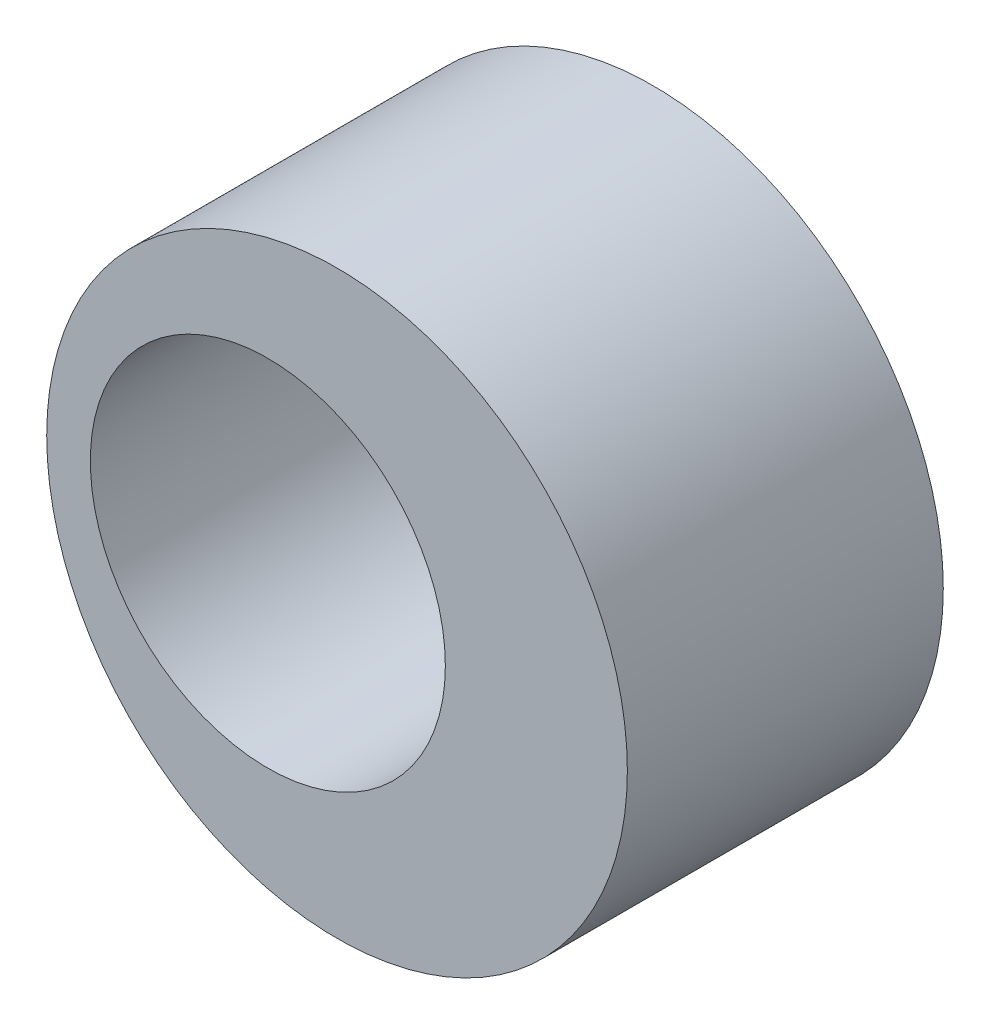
from build123d import *

# Parameters (mm, degrees)
SKETCH1_R          = 4.9022
EXTRUDE1_DEPTH     = 5.715
SKETCH4_R          = 2.9972
CUT_EXTRUDE2_DEPTH = 10.671865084
SKETCH6_OUTSIDE_W  = 14.805
SKETCH6_OUTSIDE_H  = 14.804
SKETCH6_OUTSIDE_R  = 3.556
CUT_EXTRUDE4_DEPTH = 0.381


with BuildPart() as part:
    # Sketch1 → Extrude1 (new body)
    with BuildSketch(Plane.XY):
        with Locations((1.1684, 0)):
            Circle(SKETCH1_R)
    extrude(amount=EXTRUDE1_DEPTH)

    # Sketch4 → Cut-Extrude2 (cut, through all)
    with BuildSketch(Plane.XY.offset(5.715)):
        Circle(SKETCH4_R)
    extrude(amount=-CUT_EXTRUDE2_DEPTH, mode=Mode.SUBTRACT)

    # Sketch6 outside → Cut-Extrude4 (cut)
    with BuildSketch(Plane(origin=(0, 0, 0), x_dir=(-1, 0, 0), z_dir=(0, 0, -1))):
        with Locations((-1.1685, 0)):
            Rectangle(SKETCH6_OUTSIDE_W, SKETCH6_OUTSIDE_H)
        Circle(SKETCH6_OUTSIDE_R, mode=Mode.SUBTRACT)
    extrude(amount=-CUT_EXTRUDE4_DEPTH, mode=Mode.SUBTRACT)


solid = part.part
